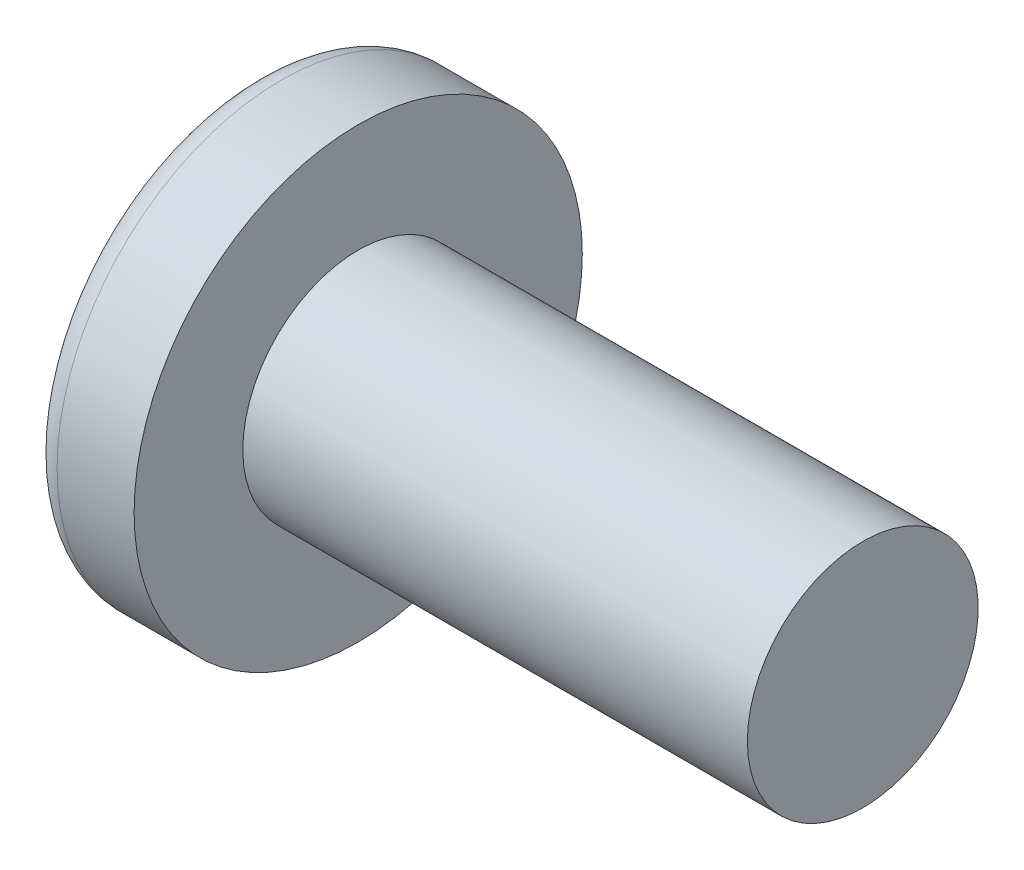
ISO-10303-21;
HEADER;
FILE_DESCRIPTION(('STEP AP214'),'2;1');
FILE_NAME('part.step','',(''),(''),'','','');
FILE_SCHEMA(('AUTOMOTIVE_DESIGN { 1 0 10303 214 1 1 1 1 }'));
ENDSEC;
DATA;
#1=APPLICATION_CONTEXT('core data for automotive mechanical design processes');
#2=APPLICATION_PROTOCOL_DEFINITION('international standard','automotive_design',2000,#1);
#3=PRODUCT_CONTEXT('',#1,'mechanical');
#4=PRODUCT('Part','Part','',(#3));
#5=PRODUCT_RELATED_PRODUCT_CATEGORY('part','',(#4));
#6=PRODUCT_DEFINITION_FORMATION('','',#4);
#7=PRODUCT_DEFINITION_CONTEXT('part definition',#1,'design');
#8=PRODUCT_DEFINITION('design','',#6,#7);
#9=PRODUCT_DEFINITION_SHAPE('','',#8);
#10=(LENGTH_UNIT() NAMED_UNIT(*) SI_UNIT(.MILLI.,.METRE.));
#11=(NAMED_UNIT(*) PLANE_ANGLE_UNIT() SI_UNIT($,.RADIAN.));
#12=(NAMED_UNIT(*) SI_UNIT($,.STERADIAN.) SOLID_ANGLE_UNIT());
#13=UNCERTAINTY_MEASURE_WITH_UNIT(LENGTH_MEASURE(1.E-05),#10,'distance_accuracy_value','');
#14=(GEOMETRIC_REPRESENTATION_CONTEXT(3) GLOBAL_UNCERTAINTY_ASSIGNED_CONTEXT((#13)) GLOBAL_UNIT_ASSIGNED_CONTEXT((#10,
#11,#12)) REPRESENTATION_CONTEXT('',''));
#15=CARTESIAN_POINT('',(0.,0.,0.));
#16=DIRECTION('',(0.,0.,1.));
#17=DIRECTION('',(1.,0.,0.));
#18=AXIS2_PLACEMENT_3D('',#15,#16,#17);
#19=CARTESIAN_POINT('',(3.49504,0.,0.));
#20=DIRECTION('',(-1.,0.,0.));
#21=DIRECTION('',(0.,1.,0.));
#22=AXIS2_PLACEMENT_3D('',#19,#20,#21);
#23=SPHERICAL_SURFACE('',#22,3.49504);
#24=CARTESIAN_POINT('',(0.638066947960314,0.,0.));
#25=DIRECTION('',(-1.,0.,0.));
#26=DIRECTION('',(0.,0.,1.));
#27=AXIS2_PLACEMENT_3D('',#24,#25,#26);
#28=CIRCLE('',#27,2.01320877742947);
#29=CARTESIAN_POINT('',(0.638066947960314,0.,2.01320877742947));
#30=VERTEX_POINT('',#29);
#31=EDGE_CURVE('E186',#30,#30,#28,.T.);
#32=ORIENTED_EDGE('',*,*,#31,.T.);
#33=EDGE_LOOP('',(#32));
#34=FACE_BOUND('',#33,.T.);
#35=CARTESIAN_POINT('',(3.48860800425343,-0.0562204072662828,0.));
#36=DIRECTION('',(-0.113665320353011,-0.99351909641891,0.));
#37=DIRECTION('',(0.99351909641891,-0.113665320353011,0.));
#38=AXIS2_PLACEMENT_3D('',#35,#36,#37);
#39=CIRCLE('',#38,3.49458187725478);
#40=CARTESIAN_POINT('',(0.227775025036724,0.316840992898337,1.19995665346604));
#41=VERTEX_POINT('',#40);
#42=CARTESIAN_POINT('',(0.0330603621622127,0.339117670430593,0.339117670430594));
#43=VERTEX_POINT('',#42);
#44=EDGE_CURVE('E224',#41,#43,#39,.T.);
#45=ORIENTED_EDGE('',*,*,#44,.F.);
#46=CARTESIAN_POINT('',(2.78874832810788,0.,-0.872695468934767));
#47=DIRECTION('',(0.629103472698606,0.,0.777321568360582));
#48=DIRECTION('',(0.777321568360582,0.,-0.629103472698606));
#49=AXIS2_PLACEMENT_3D('',#46,#47,#48);
#50=CIRCLE('',#49,3.30981257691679);
#51=CARTESIAN_POINT('',(0.227775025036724,-0.316840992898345,1.19995665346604));
#52=VERTEX_POINT('',#51);
#53=EDGE_CURVE('E181',#41,#52,#50,.T.);
#54=ORIENTED_EDGE('',*,*,#53,.T.);
#55=CARTESIAN_POINT('',(3.48860800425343,0.0562204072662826,0.));
#56=DIRECTION('',(-0.113665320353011,0.99351909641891,0.));
#57=DIRECTION('',(-0.99351909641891,-0.113665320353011,0.));
#58=AXIS2_PLACEMENT_3D('',#55,#56,#57);
#59=CIRCLE('',#58,3.49458187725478);
#60=CARTESIAN_POINT('',(0.0330603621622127,-0.339117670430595,0.339117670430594));
#61=VERTEX_POINT('',#60);
#62=EDGE_CURVE('E129',#61,#52,#59,.T.);
#63=ORIENTED_EDGE('',*,*,#62,.F.);
#64=CARTESIAN_POINT('',(3.48860800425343,0.,-0.0562204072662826));
#65=DIRECTION('',(-0.113665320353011,0.,-0.99351909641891));
#66=DIRECTION('',(-0.99351909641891,0.,0.113665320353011));
#67=AXIS2_PLACEMENT_3D('',#64,#65,#66);
#68=CIRCLE('',#67,3.49458187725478);
#69=CARTESIAN_POINT('',(0.227775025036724,-1.19995665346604,0.316840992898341));
#70=VERTEX_POINT('',#69);
#71=EDGE_CURVE('E156',#70,#61,#68,.T.);
#72=ORIENTED_EDGE('',*,*,#71,.F.);
#73=CARTESIAN_POINT('',(2.78874832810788,0.872695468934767,0.));
#74=DIRECTION('',(0.629103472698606,-0.777321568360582,0.));
#75=DIRECTION('',(0.777321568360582,0.629103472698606,0.));
#76=AXIS2_PLACEMENT_3D('',#73,#74,#75);
#77=CIRCLE('',#76,3.30981257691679);
#78=CARTESIAN_POINT('',(0.227775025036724,-1.19995665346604,-0.316840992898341));
#79=VERTEX_POINT('',#78);
#80=EDGE_CURVE('E165',#70,#79,#77,.T.);
#81=ORIENTED_EDGE('',*,*,#80,.T.);
#82=CARTESIAN_POINT('',(3.48860800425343,0.,0.0562204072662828));
#83=DIRECTION('',(-0.113665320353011,0.,0.99351909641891));
#84=DIRECTION('',(0.99351909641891,0.,0.113665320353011));
#85=AXIS2_PLACEMENT_3D('',#82,#83,#84);
#86=CIRCLE('',#85,3.49458187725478);
#87=CARTESIAN_POINT('',(0.0330603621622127,-0.339117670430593,-0.339117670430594));
#88=VERTEX_POINT('',#87);
#89=EDGE_CURVE('E59',#88,#79,#86,.T.);
#90=ORIENTED_EDGE('',*,*,#89,.F.);
#91=CARTESIAN_POINT('',(0.227775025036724,-0.316840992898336,-1.19995665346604));
#92=VERTEX_POINT('',#91);
#93=EDGE_CURVE('E215',#92,#88,#59,.T.);
#94=ORIENTED_EDGE('',*,*,#93,.F.);
#95=CARTESIAN_POINT('',(2.78874832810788,0.,0.872695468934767));
#96=DIRECTION('',(0.629103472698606,0.,-0.777321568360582));
#97=DIRECTION('',(-0.777321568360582,0.,-0.629103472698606));
#98=AXIS2_PLACEMENT_3D('',#95,#96,#97);
#99=CIRCLE('',#98,3.30981257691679);
#100=CARTESIAN_POINT('',(0.227775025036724,0.316840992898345,-1.19995665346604));
#101=VERTEX_POINT('',#100);
#102=EDGE_CURVE('E158',#92,#101,#99,.T.);
#103=ORIENTED_EDGE('',*,*,#102,.T.);
#104=CARTESIAN_POINT('',(0.0330603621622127,0.339117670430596,-0.339117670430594));
#105=VERTEX_POINT('',#104);
#106=EDGE_CURVE('E233',#105,#101,#39,.T.);
#107=ORIENTED_EDGE('',*,*,#106,.F.);
#108=CARTESIAN_POINT('',(0.227775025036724,1.19995665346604,-0.316840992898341));
#109=VERTEX_POINT('',#108);
#110=EDGE_CURVE('E49',#109,#105,#86,.T.);
#111=ORIENTED_EDGE('',*,*,#110,.F.);
#112=CARTESIAN_POINT('',(2.78874832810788,-0.872695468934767,0.));
#113=DIRECTION('',(0.629103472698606,0.777321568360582,0.));
#114=DIRECTION('',(-0.777321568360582,0.629103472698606,0.));
#115=AXIS2_PLACEMENT_3D('',#112,#113,#114);
#116=CIRCLE('',#115,3.30981257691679);
#117=CARTESIAN_POINT('',(0.227775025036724,1.19995665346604,0.316840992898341));
#118=VERTEX_POINT('',#117);
#119=EDGE_CURVE('E11',#109,#118,#116,.T.);
#120=ORIENTED_EDGE('',*,*,#119,.T.);
#121=EDGE_CURVE('E204',#43,#118,#68,.T.);
#122=ORIENTED_EDGE('',*,*,#121,.F.);
#123=EDGE_LOOP('',(#45,#54,#63,#72,#81,#90,#94,#103,#107,#111,#120,#122));
#124=FACE_BOUND('',#123,.T.);
#125=ADVANCED_FACE('F40',(#34,#124),#23,.T.);
#126=CARTESIAN_POINT('',(1.71044397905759,0.,-0.147213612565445));
#127=DIRECTION('',(-0.113665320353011,0.,0.99351909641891));
#128=DIRECTION('',(0.99351909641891,0.,0.113665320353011));
#129=AXIS2_PLACEMENT_3D('',#126,#127,#128);
#130=PLANE('',#129);
#131=ORIENTED_EDGE('',*,*,#110,.T.);
#132=DIRECTION('',(0.987162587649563,-0.112938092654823,0.112938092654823));
#133=VECTOR('',#132,1.);
#134=CARTESIAN_POINT('',(1.72685656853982,0.145335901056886,-0.145335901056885));
#135=LINE('',#134,#133);
#136=CARTESIAN_POINT('',(1.4986,0.171450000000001,-0.171449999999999));
#137=VERTEX_POINT('',#136);
#138=EDGE_CURVE('E232',#105,#137,#135,.T.);
#139=ORIENTED_EDGE('',*,*,#138,.T.);
#140=DIRECTION('',(0.774265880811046,-0.626630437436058,0.0885812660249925));
#141=VECTOR('',#140,1.);
#142=CARTESIAN_POINT('',(0.,1.3843,-0.3429));
#143=LINE('',#142,#141);
#144=EDGE_CURVE('E187',#109,#137,#143,.T.);
#145=ORIENTED_EDGE('',*,*,#144,.F.);
#146=EDGE_LOOP('',(#131,#139,#145));
#147=FACE_BOUND('',#146,.T.);
#148=ADVANCED_FACE('F275',(#147),#130,.T.);
#149=DIRECTION('',(0.774265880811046,0.626630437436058,0.0885812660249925));
#150=VECTOR('',#149,1.);
#151=CARTESIAN_POINT('',(0.,-1.3843,-0.3429));
#152=LINE('',#151,#150);
#153=CARTESIAN_POINT('',(1.4986,-0.17145,-0.17145));
#154=VERTEX_POINT('',#153);
#155=EDGE_CURVE('E167',#79,#154,#152,.T.);
#156=ORIENTED_EDGE('',*,*,#155,.T.);
#157=DIRECTION('',(-0.987162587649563,-0.112938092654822,-0.112938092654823));
#158=VECTOR('',#157,1.);
#159=CARTESIAN_POINT('',(1.72685656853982,-0.145335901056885,-0.145335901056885));
#160=LINE('',#159,#158);
#161=EDGE_CURVE('E213',#154,#88,#160,.T.);
#162=ORIENTED_EDGE('',*,*,#161,.T.);
#163=ORIENTED_EDGE('',*,*,#89,.T.);
#164=EDGE_LOOP('',(#156,#162,#163));
#165=FACE_BOUND('',#164,.T.);
#166=ADVANCED_FACE('F244',(#165),#130,.T.);
#167=CARTESIAN_POINT('',(1.71044397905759,0.,0.147213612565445));
#168=DIRECTION('',(-0.113665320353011,0.,-0.99351909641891));
#169=DIRECTION('',(-0.99351909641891,0.,0.113665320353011));
#170=AXIS2_PLACEMENT_3D('',#167,#168,#169);
#171=PLANE('',#170);
#172=DIRECTION('',(0.774265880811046,-0.626630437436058,-0.0885812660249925));
#173=VECTOR('',#172,1.);
#174=CARTESIAN_POINT('',(0.,1.3843,0.3429));
#175=LINE('',#174,#173);
#176=CARTESIAN_POINT('',(1.4986,0.17145,0.17145));
#177=VERTEX_POINT('',#176);
#178=EDGE_CURVE('E240',#118,#177,#175,.T.);
#179=ORIENTED_EDGE('',*,*,#178,.T.);
#180=DIRECTION('',(-0.987162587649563,0.112938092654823,0.112938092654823));
#181=VECTOR('',#180,1.);
#182=CARTESIAN_POINT('',(1.72685656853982,0.145335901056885,0.145335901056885));
#183=LINE('',#182,#181);
#184=EDGE_CURVE('E217',#177,#43,#183,.T.);
#185=ORIENTED_EDGE('',*,*,#184,.T.);
#186=ORIENTED_EDGE('',*,*,#121,.T.);
#187=EDGE_LOOP('',(#179,#185,#186));
#188=FACE_BOUND('',#187,.T.);
#189=ADVANCED_FACE('F311',(#188),#171,.T.);
#190=ORIENTED_EDGE('',*,*,#71,.T.);
#191=DIRECTION('',(0.987162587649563,0.112938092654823,-0.112938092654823));
#192=VECTOR('',#191,1.);
#193=CARTESIAN_POINT('',(1.72685656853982,-0.145335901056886,0.145335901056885));
#194=LINE('',#193,#192);
#195=CARTESIAN_POINT('',(1.4986,-0.171450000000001,0.171449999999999));
#196=VERTEX_POINT('',#195);
#197=EDGE_CURVE('E127',#61,#196,#194,.T.);
#198=ORIENTED_EDGE('',*,*,#197,.T.);
#199=DIRECTION('',(0.774265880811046,0.626630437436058,-0.0885812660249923));
#200=VECTOR('',#199,1.);
#201=CARTESIAN_POINT('',(0.,-1.3843,0.3429));
#202=LINE('',#201,#200);
#203=EDGE_CURVE('E154',#70,#196,#202,.T.);
#204=ORIENTED_EDGE('',*,*,#203,.F.);
#205=EDGE_LOOP('',(#190,#198,#204));
#206=FACE_BOUND('',#205,.T.);
#207=ADVANCED_FACE('F153',(#206),#171,.T.);
#208=CARTESIAN_POINT('',(-25.4,0.,0.));
#209=DIRECTION('',(-1.,0.,0.));
#210=DIRECTION('',(0.,0.,1.));
#211=AXIS2_PLACEMENT_3D('',#208,#209,#210);
#212=CYLINDRICAL_SURFACE('',#211,1.0922);
#213=CARTESIAN_POINT('',(6.35,0.,0.));
#214=DIRECTION('',(-1.,0.,0.));
#215=DIRECTION('',(0.,0.,1.));
#216=AXIS2_PLACEMENT_3D('',#213,#214,#215);
#217=CIRCLE('',#216,1.0922);
#218=CARTESIAN_POINT('',(6.35,0.,1.0922));
#219=VERTEX_POINT('',#218);
#220=EDGE_CURVE('E182',#219,#219,#217,.T.);
#221=ORIENTED_EDGE('',*,*,#220,.T.);
#222=EDGE_LOOP('',(#221));
#223=FACE_BOUND('',#222,.T.);
#224=CARTESIAN_POINT('',(1.5748,0.,0.));
#225=DIRECTION('',(-1.,0.,0.));
#226=DIRECTION('',(0.,0.,1.));
#227=AXIS2_PLACEMENT_3D('',#224,#225,#226);
#228=CIRCLE('',#227,1.0922);
#229=CARTESIAN_POINT('',(1.5748,0.,1.0922));
#230=VERTEX_POINT('',#229);
#231=EDGE_CURVE('E198',#230,#230,#228,.T.);
#232=ORIENTED_EDGE('',*,*,#231,.F.);
#233=EDGE_LOOP('',(#232));
#234=FACE_BOUND('',#233,.T.);
#235=ADVANCED_FACE('F42',(#223,#234),#212,.T.);
#236=CARTESIAN_POINT('',(1.5748,1.0922,0.));
#237=DIRECTION('',(-1.,0.,0.));
#238=DIRECTION('',(0.,0.,1.));
#239=AXIS2_PLACEMENT_3D('',#236,#237,#238);
#240=PLANE('',#239);
#241=CARTESIAN_POINT('',(1.5748,0.,0.));
#242=DIRECTION('',(-1.,0.,0.));
#243=DIRECTION('',(0.,0.,1.));
#244=AXIS2_PLACEMENT_3D('',#241,#242,#243);
#245=CIRCLE('',#244,2.1209);
#246=CARTESIAN_POINT('',(1.5748,0.,2.1209));
#247=VERTEX_POINT('',#246);
#248=EDGE_CURVE('E194',#247,#247,#245,.T.);
#249=ORIENTED_EDGE('',*,*,#248,.F.);
#250=EDGE_LOOP('',(#249));
#251=FACE_BOUND('',#250,.T.);
#252=ORIENTED_EDGE('',*,*,#231,.T.);
#253=EDGE_LOOP('',(#252));
#254=FACE_BOUND('',#253,.T.);
#255=ADVANCED_FACE('F292',(#251,#254),#240,.F.);
#256=CARTESIAN_POINT('',(-25.4,0.,0.));
#257=DIRECTION('',(-1.,0.,0.));
#258=DIRECTION('',(0.,0.,1.));
#259=AXIS2_PLACEMENT_3D('',#256,#257,#258);
#260=CYLINDRICAL_SURFACE('',#259,2.1209);
#261=ORIENTED_EDGE('',*,*,#248,.T.);
#262=EDGE_LOOP('',(#261));
#263=FACE_BOUND('',#262,.T.);
#264=CARTESIAN_POINT('',(0.845695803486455,0.,0.));
#265=DIRECTION('',(-1.,0.,0.));
#266=DIRECTION('',(0.,0.,1.));
#267=AXIS2_PLACEMENT_3D('',#264,#265,#266);
#268=CIRCLE('',#267,2.1209);
#269=CARTESIAN_POINT('',(0.845695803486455,0.,2.1209));
#270=VERTEX_POINT('',#269);
#271=EDGE_CURVE('E190',#270,#270,#268,.T.);
#272=ORIENTED_EDGE('',*,*,#271,.F.);
#273=EDGE_LOOP('',(#272));
#274=FACE_BOUND('',#273,.T.);
#275=ADVANCED_FACE('F289',(#263,#274),#260,.T.);
#276=CARTESIAN_POINT('',(0.845695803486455,0.,0.));
#277=DIRECTION('',(-1.,0.,0.));
#278=DIRECTION('',(0.,0.,1.));
#279=AXIS2_PLACEMENT_3D('',#276,#277,#278);
#280=TOROIDAL_SURFACE('',#279,1.8669,0.254);
#281=ORIENTED_EDGE('',*,*,#271,.T.);
#282=EDGE_LOOP('',(#281));
#283=FACE_BOUND('',#282,.T.);
#284=ORIENTED_EDGE('',*,*,#31,.F.);
#285=EDGE_LOOP('',(#284));
#286=FACE_BOUND('',#285,.T.);
#287=ADVANCED_FACE('F286',(#283,#286),#280,.T.);
#288=CARTESIAN_POINT('',(6.35,1.0922,0.));
#289=DIRECTION('',(1.,0.,0.));
#290=DIRECTION('',(0.,0.,-1.));
#291=AXIS2_PLACEMENT_3D('',#288,#289,#290);
#292=PLANE('',#291);
#293=ORIENTED_EDGE('',*,*,#220,.F.);
#294=EDGE_LOOP('',(#293));
#295=FACE_BOUND('',#294,.T.);
#296=ADVANCED_FACE('F284',(#295),#292,.T.);
#297=CARTESIAN_POINT('',(1.4986,0.17145,0.17145));
#298=DIRECTION('',(0.629103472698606,0.777321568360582,0.));
#299=DIRECTION('',(-0.777321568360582,0.629103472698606,0.));
#300=AXIS2_PLACEMENT_3D('',#297,#298,#299);
#301=PLANE('',#300);
#302=ORIENTED_EDGE('',*,*,#144,.T.);
#303=DIRECTION('',(0.,0.,-1.));
#304=VECTOR('',#303,1.);
#305=CARTESIAN_POINT('',(1.4986,0.17145,0.17145));
#306=LINE('',#305,#304);
#307=EDGE_CURVE('E147',#177,#137,#306,.T.);
#308=ORIENTED_EDGE('',*,*,#307,.F.);
#309=ORIENTED_EDGE('',*,*,#178,.F.);
#310=ORIENTED_EDGE('',*,*,#119,.F.);
#311=EDGE_LOOP('',(#302,#308,#309,#310));
#312=FACE_BOUND('',#311,.T.);
#313=ADVANCED_FACE('F316',(#312),#301,.F.);
#314=CARTESIAN_POINT('',(0.,-1.3843,-0.3429));
#315=DIRECTION('',(0.629103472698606,-0.777321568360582,0.));
#316=DIRECTION('',(0.777321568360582,0.629103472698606,0.));
#317=AXIS2_PLACEMENT_3D('',#314,#315,#316);
#318=PLANE('',#317);
#319=ORIENTED_EDGE('',*,*,#203,.T.);
#320=DIRECTION('',(0.,0.,1.));
#321=VECTOR('',#320,1.);
#322=CARTESIAN_POINT('',(1.4986,-0.17145,-0.17145));
#323=LINE('',#322,#321);
#324=EDGE_CURVE('E146',#154,#196,#323,.T.);
#325=ORIENTED_EDGE('',*,*,#324,.F.);
#326=ORIENTED_EDGE('',*,*,#155,.F.);
#327=ORIENTED_EDGE('',*,*,#80,.F.);
#328=EDGE_LOOP('',(#319,#325,#326,#327));
#329=FACE_BOUND('',#328,.T.);
#330=ADVANCED_FACE('F162',(#329),#318,.F.);
#331=CARTESIAN_POINT('',(1.4986,0.17145,-0.17145));
#332=DIRECTION('',(-1.,0.,0.));
#333=DIRECTION('',(0.,0.,1.));
#334=AXIS2_PLACEMENT_3D('',#331,#332,#333);
#335=PLANE('',#334);
#336=DIRECTION('',(0.,1.,0.));
#337=VECTOR('',#336,1.);
#338=CARTESIAN_POINT('',(1.4986,-0.17145,-0.17145));
#339=LINE('',#338,#337);
#340=EDGE_CURVE('E171',#154,#137,#339,.T.);
#341=ORIENTED_EDGE('',*,*,#340,.F.);
#342=ORIENTED_EDGE('',*,*,#324,.T.);
#343=DIRECTION('',(0.,-1.,0.));
#344=VECTOR('',#343,1.);
#345=CARTESIAN_POINT('',(1.4986,0.17145,0.17145));
#346=LINE('',#345,#344);
#347=EDGE_CURVE('E137',#177,#196,#346,.T.);
#348=ORIENTED_EDGE('',*,*,#347,.F.);
#349=ORIENTED_EDGE('',*,*,#307,.T.);
#350=EDGE_LOOP('',(#341,#342,#348,#349));
#351=FACE_BOUND('',#350,.T.);
#352=ADVANCED_FACE('F169',(#351),#335,.T.);
#353=CARTESIAN_POINT('',(0.,0.342900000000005,-1.3843));
#354=DIRECTION('',(0.629103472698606,0.,-0.777321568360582));
#355=DIRECTION('',(0.777321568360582,0.,0.629103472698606));
#356=AXIS2_PLACEMENT_3D('',#353,#354,#355);
#357=PLANE('',#356);
#358=DIRECTION('',(0.774265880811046,0.0885812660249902,0.626630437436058));
#359=VECTOR('',#358,1.);
#360=CARTESIAN_POINT('',(0.,-0.342899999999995,-1.3843));
#361=LINE('',#360,#359);
#362=EDGE_CURVE('E257',#92,#154,#361,.T.);
#363=ORIENTED_EDGE('',*,*,#362,.T.);
#364=ORIENTED_EDGE('',*,*,#340,.T.);
#365=DIRECTION('',(0.774265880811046,-0.0885812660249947,0.626630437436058));
#366=VECTOR('',#365,1.);
#367=CARTESIAN_POINT('',(0.,0.342900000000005,-1.3843));
#368=LINE('',#367,#366);
#369=EDGE_CURVE('E134',#101,#137,#368,.T.);
#370=ORIENTED_EDGE('',*,*,#369,.F.);
#371=ORIENTED_EDGE('',*,*,#102,.F.);
#372=EDGE_LOOP('',(#363,#364,#370,#371));
#373=FACE_BOUND('',#372,.T.);
#374=ADVANCED_FACE('F260',(#373),#357,.F.);
#375=CARTESIAN_POINT('',(1.71044397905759,-0.147213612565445,0.));
#376=DIRECTION('',(-0.113665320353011,0.99351909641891,0.));
#377=DIRECTION('',(-0.99351909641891,-0.113665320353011,0.));
#378=AXIS2_PLACEMENT_3D('',#375,#376,#377);
#379=PLANE('',#378);
#380=ORIENTED_EDGE('',*,*,#93,.T.);
#381=ORIENTED_EDGE('',*,*,#161,.F.);
#382=ORIENTED_EDGE('',*,*,#362,.F.);
#383=EDGE_LOOP('',(#380,#381,#382));
#384=FACE_BOUND('',#383,.T.);
#385=ADVANCED_FACE('F262',(#384),#379,.T.);
#386=CARTESIAN_POINT('',(1.71044397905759,0.147213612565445,0.));
#387=DIRECTION('',(-0.113665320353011,-0.99351909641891,0.));
#388=DIRECTION('',(0.99351909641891,-0.113665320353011,0.));
#389=AXIS2_PLACEMENT_3D('',#386,#387,#388);
#390=PLANE('',#389);
#391=ORIENTED_EDGE('',*,*,#106,.T.);
#392=ORIENTED_EDGE('',*,*,#369,.T.);
#393=ORIENTED_EDGE('',*,*,#138,.F.);
#394=EDGE_LOOP('',(#391,#392,#393));
#395=FACE_BOUND('',#394,.T.);
#396=ADVANCED_FACE('F264',(#395),#390,.T.);
#397=CARTESIAN_POINT('',(1.4986,-0.171450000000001,0.171449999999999));
#398=DIRECTION('',(0.629103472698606,0.,0.777321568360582));
#399=DIRECTION('',(-0.777321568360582,0.,0.629103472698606));
#400=AXIS2_PLACEMENT_3D('',#397,#398,#399);
#401=PLANE('',#400);
#402=DIRECTION('',(0.774265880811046,-0.0885812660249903,-0.626630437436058));
#403=VECTOR('',#402,1.);
#404=CARTESIAN_POINT('',(0.,0.342899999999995,1.3843));
#405=LINE('',#404,#403);
#406=EDGE_CURVE('E133',#41,#177,#405,.T.);
#407=ORIENTED_EDGE('',*,*,#406,.T.);
#408=ORIENTED_EDGE('',*,*,#347,.T.);
#409=DIRECTION('',(0.774265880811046,0.0885812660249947,-0.626630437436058));
#410=VECTOR('',#409,1.);
#411=CARTESIAN_POINT('',(0.,-0.342900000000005,1.3843));
#412=LINE('',#411,#410);
#413=EDGE_CURVE('E123',#52,#196,#412,.T.);
#414=ORIENTED_EDGE('',*,*,#413,.F.);
#415=ORIENTED_EDGE('',*,*,#53,.F.);
#416=EDGE_LOOP('',(#407,#408,#414,#415));
#417=FACE_BOUND('',#416,.T.);
#418=ADVANCED_FACE('F138',(#417),#401,.F.);
#419=ORIENTED_EDGE('',*,*,#44,.T.);
#420=ORIENTED_EDGE('',*,*,#184,.F.);
#421=ORIENTED_EDGE('',*,*,#406,.F.);
#422=EDGE_LOOP('',(#419,#420,#421));
#423=FACE_BOUND('',#422,.T.);
#424=ADVANCED_FACE('F249',(#423),#390,.T.);
#425=ORIENTED_EDGE('',*,*,#62,.T.);
#426=ORIENTED_EDGE('',*,*,#413,.T.);
#427=ORIENTED_EDGE('',*,*,#197,.F.);
#428=EDGE_LOOP('',(#425,#426,#427));
#429=FACE_BOUND('',#428,.T.);
#430=ADVANCED_FACE('F125',(#429),#379,.T.);
#431=CLOSED_SHELL('',(#125,#148,#166,#189,#207,#235,#255,#275,#287,#296,#313,#330,#352,#374,
#385,#396,#418,#424,#430));
#432=MANIFOLD_SOLID_BREP('B2',#431);
#433=ADVANCED_BREP_SHAPE_REPRESENTATION('',(#18,#432),#14);
#434=SHAPE_DEFINITION_REPRESENTATION(#9,#433);
ENDSEC;
END-ISO-10303-21;
